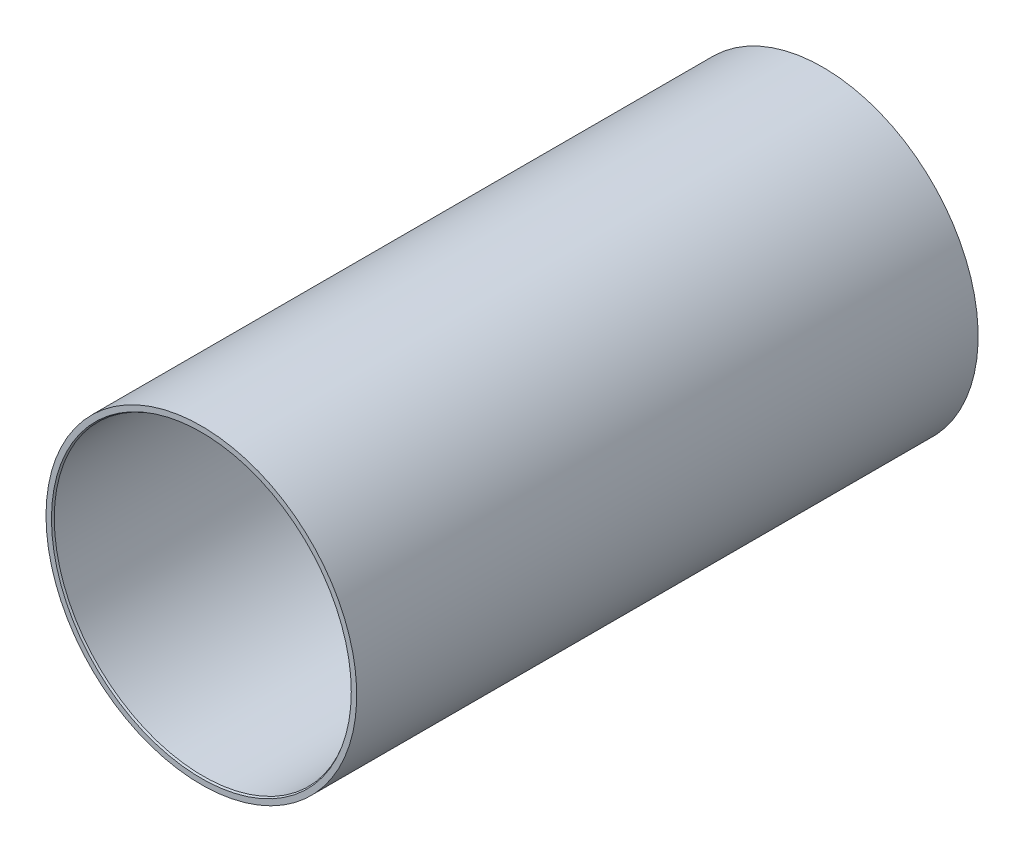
ISO-10303-21;
HEADER;
FILE_DESCRIPTION(('STEP AP214'),'2;1');
FILE_NAME('part.step','',(''),(''),'','','');
FILE_SCHEMA(('AUTOMOTIVE_DESIGN { 1 0 10303 214 1 1 1 1 }'));
ENDSEC;
DATA;
#1=APPLICATION_CONTEXT('core data for automotive mechanical design processes');
#2=APPLICATION_PROTOCOL_DEFINITION('international standard','automotive_design',2000,#1);
#3=PRODUCT_CONTEXT('',#1,'mechanical');
#4=PRODUCT('Part','Part','',(#3));
#5=PRODUCT_RELATED_PRODUCT_CATEGORY('part','',(#4));
#6=PRODUCT_DEFINITION_FORMATION('','',#4);
#7=PRODUCT_DEFINITION_CONTEXT('part definition',#1,'design');
#8=PRODUCT_DEFINITION('design','',#6,#7);
#9=PRODUCT_DEFINITION_SHAPE('','',#8);
#10=(LENGTH_UNIT() NAMED_UNIT(*) SI_UNIT(.MILLI.,.METRE.));
#11=(NAMED_UNIT(*) PLANE_ANGLE_UNIT() SI_UNIT($,.RADIAN.));
#12=(NAMED_UNIT(*) SI_UNIT($,.STERADIAN.) SOLID_ANGLE_UNIT());
#13=UNCERTAINTY_MEASURE_WITH_UNIT(LENGTH_MEASURE(1.E-05),#10,'distance_accuracy_value','');
#14=(GEOMETRIC_REPRESENTATION_CONTEXT(3) GLOBAL_UNCERTAINTY_ASSIGNED_CONTEXT((#13)) GLOBAL_UNIT_ASSIGNED_CONTEXT((#10,
#11,#12)) REPRESENTATION_CONTEXT('',''));
#15=CARTESIAN_POINT('',(0.,0.,0.));
#16=DIRECTION('',(0.,0.,1.));
#17=DIRECTION('',(1.,0.,0.));
#18=AXIS2_PLACEMENT_3D('',#15,#16,#17);
#19=CARTESIAN_POINT('',(0.,0.,609.6));
#20=DIRECTION('',(0.,0.,1.));
#21=DIRECTION('',(1.,0.,0.));
#22=AXIS2_PLACEMENT_3D('',#19,#20,#21);
#23=PLANE('',#22);
#24=CARTESIAN_POINT('',(0.,0.,609.6));
#25=DIRECTION('',(0.,0.,1.));
#26=DIRECTION('',(1.,0.,0.));
#27=AXIS2_PLACEMENT_3D('',#24,#25,#26);
#28=CIRCLE('',#27,147.066000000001);
#29=CARTESIAN_POINT('',(147.066000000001,0.,609.6));
#30=VERTEX_POINT('',#29);
#31=EDGE_CURVE('E42',#30,#30,#28,.F.);
#32=ORIENTED_EDGE('',*,*,#31,.T.);
#33=EDGE_LOOP('',(#32));
#34=FACE_BOUND('',#33,.T.);
#35=CARTESIAN_POINT('',(0.,0.,609.6));
#36=DIRECTION('',(0.,0.,1.));
#37=DIRECTION('',(1.,0.,0.));
#38=AXIS2_PLACEMENT_3D('',#35,#36,#37);
#39=CIRCLE('',#38,152.4);
#40=CARTESIAN_POINT('',(-152.4,0.,609.6));
#41=VERTEX_POINT('',#40);
#42=EDGE_CURVE('E55',#41,#41,#39,.T.);
#43=ORIENTED_EDGE('',*,*,#42,.T.);
#44=EDGE_LOOP('',(#43));
#45=FACE_BOUND('',#44,.T.);
#46=ADVANCED_FACE('F35',(#34,#45),#23,.T.);
#47=CARTESIAN_POINT('',(0.,0.,0.));
#48=DIRECTION('',(0.,0.,1.));
#49=DIRECTION('',(1.,0.,0.));
#50=AXIS2_PLACEMENT_3D('',#47,#48,#49);
#51=PLANE('',#50);
#52=CARTESIAN_POINT('',(0.,0.,0.));
#53=DIRECTION('',(0.,0.,1.));
#54=DIRECTION('',(1.,0.,0.));
#55=AXIS2_PLACEMENT_3D('',#52,#53,#54);
#56=CIRCLE('',#55,147.066000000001);
#57=CARTESIAN_POINT('',(-147.066000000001,0.,0.));
#58=VERTEX_POINT('',#57);
#59=EDGE_CURVE('E10',#58,#58,#56,.T.);
#60=ORIENTED_EDGE('',*,*,#59,.T.);
#61=EDGE_LOOP('',(#60));
#62=FACE_BOUND('',#61,.T.);
#63=CARTESIAN_POINT('',(0.,0.,0.));
#64=DIRECTION('',(0.,0.,1.));
#65=DIRECTION('',(1.,0.,0.));
#66=AXIS2_PLACEMENT_3D('',#63,#64,#65);
#67=CIRCLE('',#66,152.4);
#68=CARTESIAN_POINT('',(-152.4,0.,0.));
#69=VERTEX_POINT('',#68);
#70=EDGE_CURVE('E56',#69,#69,#67,.T.);
#71=ORIENTED_EDGE('',*,*,#70,.F.);
#72=EDGE_LOOP('',(#71));
#73=FACE_BOUND('',#72,.T.);
#74=ADVANCED_FACE('F67',(#62,#73),#51,.F.);
#75=CARTESIAN_POINT('',(0.,0.,609.6));
#76=DIRECTION('',(0.,0.,-1.));
#77=DIRECTION('',(-1.,0.,0.));
#78=AXIS2_PLACEMENT_3D('',#75,#76,#77);
#79=CYLINDRICAL_SURFACE('',#78,152.4);
#80=CARTESIAN_POINT('',(-152.4,0.,609.6));
#81=CARTESIAN_POINT('',(-152.4,0.,603.25));
#82=CARTESIAN_POINT('',(-152.4,0.,596.9));
#83=CARTESIAN_POINT('',(-152.4,0.,584.2));
#84=CARTESIAN_POINT('',(-152.4,0.,577.85));
#85=CARTESIAN_POINT('',(-152.4,0.,565.15));
#86=CARTESIAN_POINT('',(-152.4,0.,558.8));
#87=CARTESIAN_POINT('',(-152.4,0.,546.1));
#88=CARTESIAN_POINT('',(-152.4,0.,539.75));
#89=CARTESIAN_POINT('',(-152.4,0.,527.05));
#90=CARTESIAN_POINT('',(-152.4,0.,520.7));
#91=CARTESIAN_POINT('',(-152.4,0.,508.));
#92=CARTESIAN_POINT('',(-152.4,0.,501.65));
#93=CARTESIAN_POINT('',(-152.4,0.,488.95));
#94=CARTESIAN_POINT('',(-152.4,0.,482.6));
#95=CARTESIAN_POINT('',(-152.4,0.,469.9));
#96=CARTESIAN_POINT('',(-152.4,0.,463.55));
#97=CARTESIAN_POINT('',(-152.4,0.,450.85));
#98=CARTESIAN_POINT('',(-152.4,0.,444.5));
#99=CARTESIAN_POINT('',(-152.4,0.,431.8));
#100=CARTESIAN_POINT('',(-152.4,0.,425.45));
#101=CARTESIAN_POINT('',(-152.4,0.,412.75));
#102=CARTESIAN_POINT('',(-152.4,0.,406.4));
#103=CARTESIAN_POINT('',(-152.4,0.,393.7));
#104=CARTESIAN_POINT('',(-152.4,0.,387.35));
#105=CARTESIAN_POINT('',(-152.4,0.,374.65));
#106=CARTESIAN_POINT('',(-152.4,0.,368.3));
#107=CARTESIAN_POINT('',(-152.4,0.,355.6));
#108=CARTESIAN_POINT('',(-152.4,0.,349.25));
#109=CARTESIAN_POINT('',(-152.4,0.,336.55));
#110=CARTESIAN_POINT('',(-152.4,0.,330.2));
#111=CARTESIAN_POINT('',(-152.4,0.,317.5));
#112=CARTESIAN_POINT('',(-152.4,0.,311.15));
#113=CARTESIAN_POINT('',(-152.4,0.,298.45));
#114=CARTESIAN_POINT('',(-152.4,0.,292.1));
#115=CARTESIAN_POINT('',(-152.4,0.,279.4));
#116=CARTESIAN_POINT('',(-152.4,0.,273.05));
#117=CARTESIAN_POINT('',(-152.4,0.,260.35));
#118=CARTESIAN_POINT('',(-152.4,0.,254.));
#119=CARTESIAN_POINT('',(-152.4,0.,241.3));
#120=CARTESIAN_POINT('',(-152.4,0.,234.95));
#121=CARTESIAN_POINT('',(-152.4,0.,222.25));
#122=CARTESIAN_POINT('',(-152.4,0.,215.9));
#123=CARTESIAN_POINT('',(-152.4,0.,203.2));
#124=CARTESIAN_POINT('',(-152.4,0.,196.85));
#125=CARTESIAN_POINT('',(-152.4,0.,184.15));
#126=CARTESIAN_POINT('',(-152.4,0.,177.8));
#127=CARTESIAN_POINT('',(-152.4,0.,165.1));
#128=CARTESIAN_POINT('',(-152.4,0.,158.75));
#129=CARTESIAN_POINT('',(-152.4,0.,146.05));
#130=CARTESIAN_POINT('',(-152.4,0.,139.7));
#131=CARTESIAN_POINT('',(-152.4,0.,127.));
#132=CARTESIAN_POINT('',(-152.4,0.,120.65));
#133=CARTESIAN_POINT('',(-152.4,0.,107.95));
#134=CARTESIAN_POINT('',(-152.4,0.,101.6));
#135=CARTESIAN_POINT('',(-152.4,0.,88.9));
#136=CARTESIAN_POINT('',(-152.4,0.,82.5500000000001));
#137=CARTESIAN_POINT('',(-152.4,0.,69.85));
#138=CARTESIAN_POINT('',(-152.4,0.,63.5));
#139=CARTESIAN_POINT('',(-152.4,0.,50.8));
#140=CARTESIAN_POINT('',(-152.4,0.,44.45));
#141=CARTESIAN_POINT('',(-152.4,0.,31.75));
#142=CARTESIAN_POINT('',(-152.4,0.,25.4));
#143=CARTESIAN_POINT('',(-152.4,0.,12.7));
#144=CARTESIAN_POINT('',(-152.4,0.,6.35000000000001));
#145=CARTESIAN_POINT('',(-152.4,0.,0.));
#146=B_SPLINE_CURVE_WITH_KNOTS('',3,(#80,#81,#82,#83,#84,#85,#86,#87,#88,#89,#90,#91,#92,#93,
#94,#95,#96,#97,#98,#99,#100,#101,#102,#103,#104,#105,#106,#107,#108,#109,#110,#111,#112,#113,
#114,#115,#116,#117,#118,#119,#120,#121,#122,#123,#124,#125,#126,#127,#128,#129,#130,#131,#132,
#133,#134,#135,#136,#137,#138,#139,#140,#141,#142,#143,#144,#145),.UNSPECIFIED.,.F.,.F.,(4,2,2,
2,2,2,2,2,2,2,2,2,2,2,2,2,2,2,2,2,2,2,2,2,2,2,2,2,2,2,2,2,4),(0.,19.05,38.1,57.15,76.2,
95.2500000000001,114.3,133.35,152.4,171.45,190.5,209.55,228.6,247.65,266.7,285.75,304.8,323.85,
342.9,361.95,381.,400.05,419.1,438.15,457.2,476.25,495.3,514.35,533.4,552.45,571.5,590.55,
609.6),.UNSPECIFIED.);
#147=EDGE_CURVE('BSEAM63',#41,#69,#146,.T.);
#148=ORIENTED_EDGE('',*,*,#42,.F.);
#149=ORIENTED_EDGE('',*,*,#70,.T.);
#150=ORIENTED_EDGE('',*,*,#147,.T.);
#151=ORIENTED_EDGE('',*,*,#147,.F.);
#152=EDGE_LOOP('',(#148,#150,#149,#151));
#153=FACE_BOUND('',#152,.T.);
#154=ADVANCED_FACE('F63',(#153),#79,.T.);
#155=CARTESIAN_POINT('',(0.,0.,609.6));
#156=DIRECTION('',(0.,0.,-1.));
#157=DIRECTION('',(-1.,0.,0.));
#158=AXIS2_PLACEMENT_3D('',#155,#156,#157);
#159=CYLINDRICAL_SURFACE('',#158,146.05);
#160=CARTESIAN_POINT('',(0.,0.,607.840236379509));
#161=DIRECTION('',(0.,0.,1.));
#162=DIRECTION('',(1.,0.,0.));
#163=AXIS2_PLACEMENT_3D('',#160,#161,#162);
#164=CIRCLE('',#163,146.05);
#165=CARTESIAN_POINT('',(-146.05,0.,607.840236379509));
#166=VERTEX_POINT('',#165);
#167=EDGE_CURVE('E46',#166,#166,#164,.T.);
#168=CARTESIAN_POINT('',(0.,0.,1.75976362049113));
#169=DIRECTION('',(0.,0.,1.));
#170=DIRECTION('',(1.,0.,0.));
#171=AXIS2_PLACEMENT_3D('',#168,#169,#170);
#172=CIRCLE('',#171,146.05);
#173=CARTESIAN_POINT('',(-146.05,0.,1.75976362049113));
#174=VERTEX_POINT('',#173);
#175=EDGE_CURVE('E50',#174,#174,#172,.F.);
#176=CARTESIAN_POINT('',(-146.05,0.,607.840236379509));
#177=CARTESIAN_POINT('',(-146.05,0.,601.526898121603));
#178=CARTESIAN_POINT('',(-146.05,0.,595.213559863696));
#179=CARTESIAN_POINT('',(-146.05,0.,582.586883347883));
#180=CARTESIAN_POINT('',(-146.05,0.,576.273545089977));
#181=CARTESIAN_POINT('',(-146.05,0.,563.646868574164));
#182=CARTESIAN_POINT('',(-146.05,0.,557.333530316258));
#183=CARTESIAN_POINT('',(-146.05,0.,544.706853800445));
#184=CARTESIAN_POINT('',(-146.05,0.,538.393515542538));
#185=CARTESIAN_POINT('',(-146.05,0.,525.766839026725));
#186=CARTESIAN_POINT('',(-146.05,0.,519.453500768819));
#187=CARTESIAN_POINT('',(-146.05,0.,506.826824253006));
#188=CARTESIAN_POINT('',(-146.05,0.,500.5134859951));
#189=CARTESIAN_POINT('',(-146.05,0.,487.886809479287));
#190=CARTESIAN_POINT('',(-146.05,0.,481.57347122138));
#191=CARTESIAN_POINT('',(-146.05,0.,468.946794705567));
#192=CARTESIAN_POINT('',(-146.05,0.,462.633456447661));
#193=CARTESIAN_POINT('',(-146.05,0.,450.006779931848));
#194=CARTESIAN_POINT('',(-146.05,0.,443.693441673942));
#195=CARTESIAN_POINT('',(-146.05,0.,431.066765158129));
#196=CARTESIAN_POINT('',(-146.05,0.,424.753426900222));
#197=CARTESIAN_POINT('',(-146.05,0.,412.12675038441));
#198=CARTESIAN_POINT('',(-146.05,0.,405.813412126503));
#199=CARTESIAN_POINT('',(-146.05,0.,393.18673561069));
#200=CARTESIAN_POINT('',(-146.05,0.,386.873397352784));
#201=CARTESIAN_POINT('',(-146.05,0.,374.246720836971));
#202=CARTESIAN_POINT('',(-146.05,0.,367.933382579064));
#203=CARTESIAN_POINT('',(-146.05,0.,355.306706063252));
#204=CARTESIAN_POINT('',(-146.05,0.,348.993367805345));
#205=CARTESIAN_POINT('',(-146.05,0.,336.366691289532));
#206=CARTESIAN_POINT('',(-146.05,0.,330.053353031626));
#207=CARTESIAN_POINT('',(-146.05,0.,317.426676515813));
#208=CARTESIAN_POINT('',(-146.05,0.,311.113338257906));
#209=CARTESIAN_POINT('',(-146.05,0.,298.486661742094));
#210=CARTESIAN_POINT('',(-146.05,0.,292.173323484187));
#211=CARTESIAN_POINT('',(-146.05,0.,279.546646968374));
#212=CARTESIAN_POINT('',(-146.05,0.,273.233308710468));
#213=CARTESIAN_POINT('',(-146.05,0.,260.606632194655));
#214=CARTESIAN_POINT('',(-146.05,0.,254.293293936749));
#215=CARTESIAN_POINT('',(-146.05,0.,241.666617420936));
#216=CARTESIAN_POINT('',(-146.05,0.,235.353279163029));
#217=CARTESIAN_POINT('',(-146.05,0.,222.726602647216));
#218=CARTESIAN_POINT('',(-146.05,0.,216.41326438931));
#219=CARTESIAN_POINT('',(-146.05,0.,203.786587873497));
#220=CARTESIAN_POINT('',(-146.05,0.,197.473249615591));
#221=CARTESIAN_POINT('',(-146.05,0.,184.846573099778));
#222=CARTESIAN_POINT('',(-146.05,0.,178.533234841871));
#223=CARTESIAN_POINT('',(-146.05,0.,165.906558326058));
#224=CARTESIAN_POINT('',(-146.05,0.,159.593220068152));
#225=CARTESIAN_POINT('',(-146.05,0.,146.966543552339));
#226=CARTESIAN_POINT('',(-146.05,0.,140.653205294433));
#227=CARTESIAN_POINT('',(-146.05,0.,128.02652877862));
#228=CARTESIAN_POINT('',(-146.05,0.,121.713190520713));
#229=CARTESIAN_POINT('',(-146.05,0.,109.086514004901));
#230=CARTESIAN_POINT('',(-146.05,0.,102.773175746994));
#231=CARTESIAN_POINT('',(-146.05,0.,90.1464992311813));
#232=CARTESIAN_POINT('',(-146.05,0.,83.8331609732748));
#233=CARTESIAN_POINT('',(-146.05,0.,71.206484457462));
#234=CARTESIAN_POINT('',(-146.05,0.,64.8931461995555));
#235=CARTESIAN_POINT('',(-146.05,0.,52.2664696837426));
#236=CARTESIAN_POINT('',(-146.05,0.,45.9531314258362));
#237=CARTESIAN_POINT('',(-146.05,0.,33.3264549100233));
#238=CARTESIAN_POINT('',(-146.05,0.,27.0131166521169));
#239=CARTESIAN_POINT('',(-146.05,0.,14.386440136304));
#240=CARTESIAN_POINT('',(-146.05,0.,8.07310187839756));
#241=CARTESIAN_POINT('',(-146.05,0.,1.75976362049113));
#242=B_SPLINE_CURVE_WITH_KNOTS('',3,(#176,#177,#178,#179,#180,#181,#182,#183,#184,#185,#186,
#187,#188,#189,#190,#191,#192,#193,#194,#195,#196,#197,#198,#199,#200,#201,#202,#203,#204,#205,
#206,#207,#208,#209,#210,#211,#212,#213,#214,#215,#216,#217,#218,#219,#220,#221,#222,#223,#224,
#225,#226,#227,#228,#229,#230,#231,#232,#233,#234,#235,#236,#237,#238,#239,#240,#241),
.UNSPECIFIED.,.F.,.F.,(4,2,2,2,2,2,2,2,2,2,2,2,2,2,2,2,2,2,2,2,2,2,2,2,2,2,2,2,2,2,2,2,4),(0.,
18.9400147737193,37.8800295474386,56.820044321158,75.7600590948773,94.7000738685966,
113.640088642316,132.580103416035,151.520118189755,170.460132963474,189.400147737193,
208.340162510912,227.280177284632,246.220192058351,265.16020683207,284.10022160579,
303.040236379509,321.980251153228,340.920265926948,359.860280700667,378.800295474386,
397.740310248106,416.680325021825,435.620339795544,454.560354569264,473.500369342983,
492.440384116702,511.380398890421,530.320413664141,549.26042843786,568.200443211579,
587.140457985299,606.080472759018),.UNSPECIFIED.);
#243=EDGE_CURVE('BSEAM66',#166,#174,#242,.T.);
#244=ORIENTED_EDGE('',*,*,#167,.T.);
#245=ORIENTED_EDGE('',*,*,#175,.T.);
#246=ORIENTED_EDGE('',*,*,#243,.T.);
#247=ORIENTED_EDGE('',*,*,#243,.F.);
#248=EDGE_LOOP('',(#244,#246,#245,#247));
#249=FACE_BOUND('',#248,.T.);
#250=ADVANCED_FACE('F66',(#249),#159,.F.);
#251=CARTESIAN_POINT('',(0.,0.,607.840236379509));
#252=DIRECTION('',(0.,0.,1.));
#253=DIRECTION('',(1.,0.,0.));
#254=AXIS2_PLACEMENT_3D('',#251,#252,#253);
#255=CONICAL_SURFACE('',#254,146.05,0.523598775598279);
#256=ORIENTED_EDGE('',*,*,#31,.F.);
#257=EDGE_LOOP('',(#256));
#258=FACE_BOUND('',#257,.T.);
#259=ORIENTED_EDGE('',*,*,#167,.F.);
#260=EDGE_LOOP('',(#259));
#261=FACE_BOUND('',#260,.T.);
#262=ADVANCED_FACE('F78',(#258,#261),#255,.F.);
#263=CARTESIAN_POINT('',(0.,0.,0.));
#264=DIRECTION('',(0.,0.,-1.));
#265=DIRECTION('',(-1.,0.,0.));
#266=AXIS2_PLACEMENT_3D('',#263,#264,#265);
#267=CONICAL_SURFACE('',#266,147.066000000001,0.523598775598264);
#268=CARTESIAN_POINT('',(-146.05,0.,1.75976362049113));
#269=CARTESIAN_POINT('',(-146.060583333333,0.,1.74143274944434));
#270=CARTESIAN_POINT('',(-146.071166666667,0.,1.72310187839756));
#271=CARTESIAN_POINT('',(-146.092333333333,0.,1.686440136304));
#272=CARTESIAN_POINT('',(-146.102916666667,0.,1.66810926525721));
#273=CARTESIAN_POINT('',(-146.124083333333,0.,1.63144752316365));
#274=CARTESIAN_POINT('',(-146.134666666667,0.,1.61311665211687));
#275=CARTESIAN_POINT('',(-146.155833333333,0.,1.5764549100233));
#276=CARTESIAN_POINT('',(-146.166416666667,0.,1.55812403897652));
#277=CARTESIAN_POINT('',(-146.187583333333,0.,1.52146229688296));
#278=CARTESIAN_POINT('',(-146.198166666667,0.,1.50313142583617));
#279=CARTESIAN_POINT('',(-146.219333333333,0.,1.4664696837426));
#280=CARTESIAN_POINT('',(-146.229916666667,0.,1.44813881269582));
#281=CARTESIAN_POINT('',(-146.251083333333,0.,1.41147707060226));
#282=CARTESIAN_POINT('',(-146.261666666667,0.,1.39314619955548));
#283=CARTESIAN_POINT('',(-146.282833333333,0.,1.35648445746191));
#284=CARTESIAN_POINT('',(-146.293416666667,0.,1.33815358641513));
#285=CARTESIAN_POINT('',(-146.314583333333,0.,1.30149184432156));
#286=CARTESIAN_POINT('',(-146.325166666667,0.,1.28316097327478));
#287=CARTESIAN_POINT('',(-146.346333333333,0.,1.24649923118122));
#288=CARTESIAN_POINT('',(-146.356916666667,0.,1.22816836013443));
#289=CARTESIAN_POINT('',(-146.378083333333,0.,1.19150661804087));
#290=CARTESIAN_POINT('',(-146.388666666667,0.,1.17317574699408));
#291=CARTESIAN_POINT('',(-146.409833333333,0.,1.13651400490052));
#292=CARTESIAN_POINT('',(-146.420416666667,0.,1.11818313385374));
#293=CARTESIAN_POINT('',(-146.441583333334,0.,1.08152139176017));
#294=CARTESIAN_POINT('',(-146.452166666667,0.,1.06319052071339));
#295=CARTESIAN_POINT('',(-146.473333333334,0.,1.02652877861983));
#296=CARTESIAN_POINT('',(-146.483916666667,0.,1.00819790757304));
#297=CARTESIAN_POINT('',(-146.505083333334,0.,0.971536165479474));
#298=CARTESIAN_POINT('',(-146.515666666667,0.,0.953205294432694));
#299=CARTESIAN_POINT('',(-146.536833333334,0.,0.91654355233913));
#300=CARTESIAN_POINT('',(-146.547416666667,0.,0.898212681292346));
#301=CARTESIAN_POINT('',(-146.568583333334,0.,0.861550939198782));
#302=CARTESIAN_POINT('',(-146.579166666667,0.,0.843220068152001));
#303=CARTESIAN_POINT('',(-146.600333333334,0.,0.806558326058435));
#304=CARTESIAN_POINT('',(-146.610916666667,0.,0.788227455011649));
#305=CARTESIAN_POINT('',(-146.632083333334,0.,0.751565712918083));
#306=CARTESIAN_POINT('',(-146.642666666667,0.,0.733234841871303));
#307=CARTESIAN_POINT('',(-146.663833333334,0.,0.696573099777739));
#308=CARTESIAN_POINT('',(-146.674416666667,0.,0.678242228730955));
#309=CARTESIAN_POINT('',(-146.695583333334,0.,0.641580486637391));
#310=CARTESIAN_POINT('',(-146.706166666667,0.,0.62324961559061));
#311=CARTESIAN_POINT('',(-146.727333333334,0.,0.586587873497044));
#312=CARTESIAN_POINT('',(-146.737916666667,0.,0.568257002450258));
#313=CARTESIAN_POINT('',(-146.759083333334,0.,0.531595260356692));
#314=CARTESIAN_POINT('',(-146.769666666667,0.,0.513264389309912));
#315=CARTESIAN_POINT('',(-146.790833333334,0.,0.476602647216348));
#316=CARTESIAN_POINT('',(-146.801416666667,0.,0.458271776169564));
#317=CARTESIAN_POINT('',(-146.822583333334,0.,0.421610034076));
#318=CARTESIAN_POINT('',(-146.833166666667,0.,0.403279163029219));
#319=CARTESIAN_POINT('',(-146.854333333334,0.,0.366617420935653));
#320=CARTESIAN_POINT('',(-146.864916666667,0.,0.348286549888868));
#321=CARTESIAN_POINT('',(-146.886083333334,0.,0.311624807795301));
#322=CARTESIAN_POINT('',(-146.896666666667,0.,0.293293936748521));
#323=CARTESIAN_POINT('',(-146.917833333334,0.,0.256632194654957));
#324=CARTESIAN_POINT('',(-146.928416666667,0.,0.238301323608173));
#325=CARTESIAN_POINT('',(-146.949583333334,0.,0.201639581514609));
#326=CARTESIAN_POINT('',(-146.960166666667,0.,0.183308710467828));
#327=CARTESIAN_POINT('',(-146.981333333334,0.,0.146646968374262));
#328=CARTESIAN_POINT('',(-146.991916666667,0.,0.128316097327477));
#329=CARTESIAN_POINT('',(-147.013083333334,0.,0.0916543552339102));
#330=CARTESIAN_POINT('',(-147.023666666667,0.,0.073323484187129));
#331=CARTESIAN_POINT('',(-147.044833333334,0.,0.0366617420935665));
#332=CARTESIAN_POINT('',(-147.055416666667,0.,0.0183308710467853));
#333=CARTESIAN_POINT('',(-147.066000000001,0.,0.));
#334=B_SPLINE_CURVE_WITH_KNOTS('',3,(#268,#269,#270,#271,#272,#273,#274,#275,#276,#277,#278,
#279,#280,#281,#282,#283,#284,#285,#286,#287,#288,#289,#290,#291,#292,#293,#294,#295,#296,#297,
#298,#299,#300,#301,#302,#303,#304,#305,#306,#307,#308,#309,#310,#311,#312,#313,#314,#315,#316,
#317,#318,#319,#320,#321,#322,#323,#324,#325,#326,#327,#328,#329,#330,#331,#332,#333),
.UNSPECIFIED.,.F.,.F.,(4,2,2,2,2,2,2,2,2,2,2,2,2,2,2,2,2,2,2,2,2,2,2,2,2,2,2,2,2,2,2,2,4),(0.,
0.0635000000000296,0.127000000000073,0.190500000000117,0.25400000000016,0.31750000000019,
0.381000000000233,0.444500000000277,0.50800000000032,0.571500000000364,0.635000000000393,
0.698500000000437,0.762000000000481,0.825500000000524,0.889000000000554,0.952500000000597,
1.01600000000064,1.07950000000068,1.14300000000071,1.20650000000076,1.2700000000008,
1.33350000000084,1.39700000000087,1.46050000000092,1.52400000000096,1.587500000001,
1.65100000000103,1.71450000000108,1.77800000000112,1.84150000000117,1.90500000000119,
1.96850000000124,2.03200000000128),.UNSPECIFIED.);
#335=EDGE_CURVE('BSEAM37',#174,#58,#334,.T.);
#336=ORIENTED_EDGE('',*,*,#175,.F.);
#337=ORIENTED_EDGE('',*,*,#59,.F.);
#338=ORIENTED_EDGE('',*,*,#335,.T.);
#339=ORIENTED_EDGE('',*,*,#335,.F.);
#340=EDGE_LOOP('',(#336,#338,#337,#339));
#341=FACE_BOUND('',#340,.T.);
#342=ADVANCED_FACE('F37',(#341),#267,.F.);
#343=CLOSED_SHELL('',(#46,#74,#154,#250,#262,#342));
#344=MANIFOLD_SOLID_BREP('B2',#343);
#345=ADVANCED_BREP_SHAPE_REPRESENTATION('',(#18,#344),#14);
#346=SHAPE_DEFINITION_REPRESENTATION(#9,#345);
ENDSEC;
END-ISO-10303-21;
